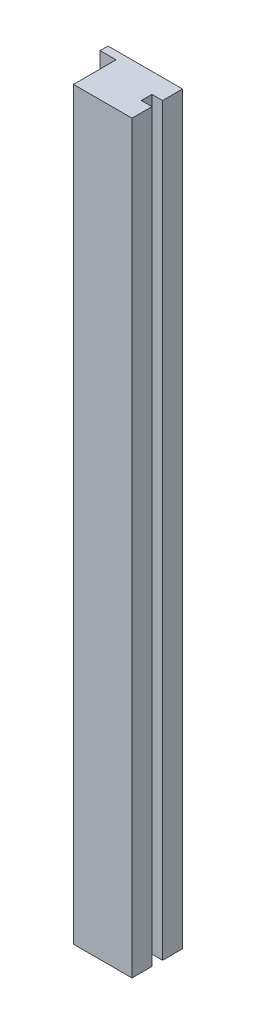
from build123d import *

# Parameters (mm, degrees)
BASE_EXTRUSION_DEPTH = 140


with BuildPart() as part:
    # Esquisse1 → Base-Extrusion (new body)
    with BuildSketch(Plane(origin=(0, 0, 0), x_dir=(1, 0, 0), z_dir=(0, 1, 0))):
        Polygon((10.996412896, 9.5), (10.996412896, 5.75), (8.996412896, 5.75), (8.996412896, 3.75), (10.996412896, 3.75), (10.996412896, 0), (0, 0), (0, 8), (-3, 8), (-3, 9.5), (0.189366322, 9.5), align=None)
    extrude(amount=BASE_EXTRUSION_DEPTH)


solid = part.part
